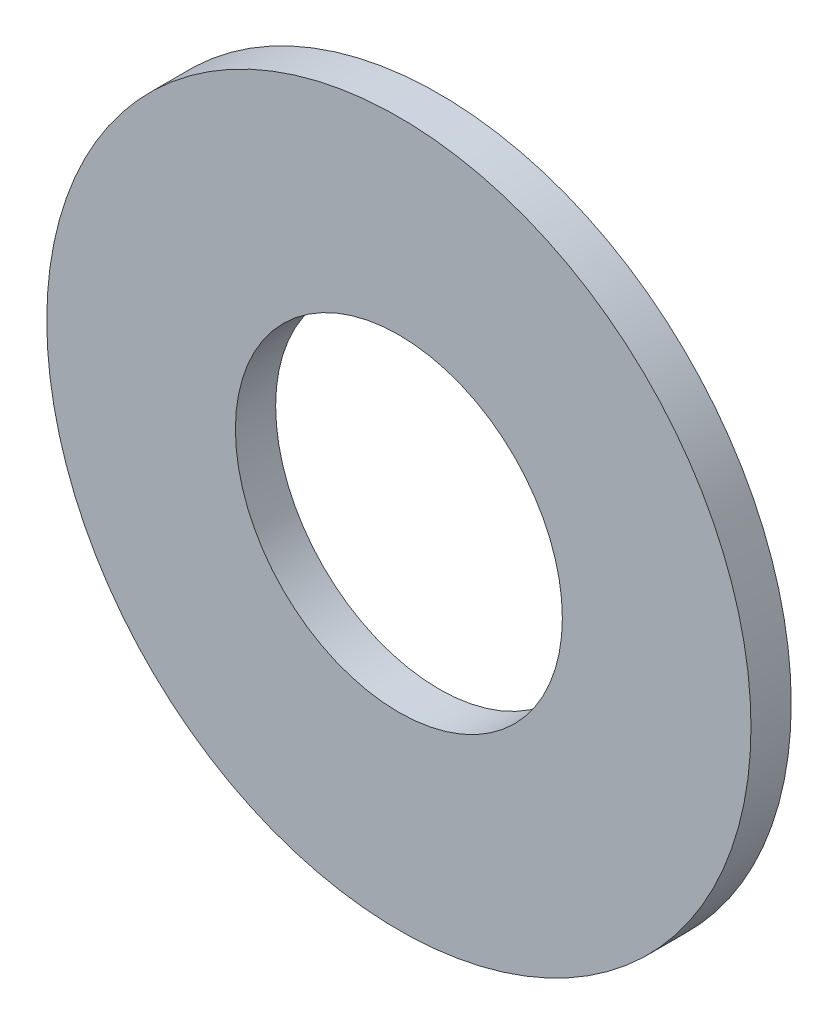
ISO-10303-21;
HEADER;
FILE_DESCRIPTION(('STEP AP214'),'2;1');
FILE_NAME('part.step','',(''),(''),'','','');
FILE_SCHEMA(('AUTOMOTIVE_DESIGN { 1 0 10303 214 1 1 1 1 }'));
ENDSEC;
DATA;
#1=APPLICATION_CONTEXT('core data for automotive mechanical design processes');
#2=APPLICATION_PROTOCOL_DEFINITION('international standard','automotive_design',2000,#1);
#3=PRODUCT_CONTEXT('',#1,'mechanical');
#4=PRODUCT('Part','Part','',(#3));
#5=PRODUCT_RELATED_PRODUCT_CATEGORY('part','',(#4));
#6=PRODUCT_DEFINITION_FORMATION('','',#4);
#7=PRODUCT_DEFINITION_CONTEXT('part definition',#1,'design');
#8=PRODUCT_DEFINITION('design','',#6,#7);
#9=PRODUCT_DEFINITION_SHAPE('','',#8);
#10=(LENGTH_UNIT() NAMED_UNIT(*) SI_UNIT(.MILLI.,.METRE.));
#11=(NAMED_UNIT(*) PLANE_ANGLE_UNIT() SI_UNIT($,.RADIAN.));
#12=(NAMED_UNIT(*) SI_UNIT($,.STERADIAN.) SOLID_ANGLE_UNIT());
#13=UNCERTAINTY_MEASURE_WITH_UNIT(LENGTH_MEASURE(1.E-05),#10,'distance_accuracy_value','');
#14=(GEOMETRIC_REPRESENTATION_CONTEXT(3) GLOBAL_UNCERTAINTY_ASSIGNED_CONTEXT((#13)) GLOBAL_UNIT_ASSIGNED_CONTEXT((#10,
#11,#12)) REPRESENTATION_CONTEXT('',''));
#15=CARTESIAN_POINT('',(0.,0.,0.));
#16=DIRECTION('',(0.,0.,1.));
#17=DIRECTION('',(1.,0.,0.));
#18=AXIS2_PLACEMENT_3D('',#15,#16,#17);
#19=CARTESIAN_POINT('',(0.,0.,1.27));
#20=DIRECTION('',(0.,0.,1.));
#21=DIRECTION('',(1.,0.,0.));
#22=AXIS2_PLACEMENT_3D('',#19,#20,#21);
#23=PLANE('',#22);
#24=CARTESIAN_POINT('',(0.,0.,1.27));
#25=DIRECTION('',(0.,0.,1.));
#26=DIRECTION('',(1.,0.,0.));
#27=AXIS2_PLACEMENT_3D('',#24,#25,#26);
#28=CIRCLE('',#27,11.1125);
#29=CARTESIAN_POINT('',(11.1125,0.,1.27));
#30=VERTEX_POINT('',#29);
#31=EDGE_CURVE('E10',#30,#30,#28,.T.);
#32=ORIENTED_EDGE('',*,*,#31,.T.);
#33=EDGE_LOOP('',(#32));
#34=FACE_BOUND('',#33,.T.);
#35=CARTESIAN_POINT('',(0.,0.,1.27));
#36=DIRECTION('',(0.,0.,1.));
#37=DIRECTION('',(1.,0.,0.));
#38=AXIS2_PLACEMENT_3D('',#35,#36,#37);
#39=CIRCLE('',#38,5.159375);
#40=CARTESIAN_POINT('',(5.159375,0.,1.27));
#41=VERTEX_POINT('',#40);
#42=EDGE_CURVE('E39',#41,#41,#39,.T.);
#43=ORIENTED_EDGE('',*,*,#42,.F.);
#44=EDGE_LOOP('',(#43));
#45=FACE_BOUND('',#44,.T.);
#46=ADVANCED_FACE('F28',(#34,#45),#23,.T.);
#47=CARTESIAN_POINT('',(0.,0.,0.));
#48=DIRECTION('',(0.,0.,1.));
#49=DIRECTION('',(1.,0.,0.));
#50=AXIS2_PLACEMENT_3D('',#47,#48,#49);
#51=PLANE('',#50);
#52=CARTESIAN_POINT('',(0.,0.,0.));
#53=DIRECTION('',(0.,0.,1.));
#54=DIRECTION('',(1.,0.,0.));
#55=AXIS2_PLACEMENT_3D('',#52,#53,#54);
#56=CIRCLE('',#55,11.1125);
#57=CARTESIAN_POINT('',(11.1125,0.,0.));
#58=VERTEX_POINT('',#57);
#59=EDGE_CURVE('E35',#58,#58,#56,.T.);
#60=ORIENTED_EDGE('',*,*,#59,.F.);
#61=EDGE_LOOP('',(#60));
#62=FACE_BOUND('',#61,.T.);
#63=CARTESIAN_POINT('',(0.,0.,0.));
#64=DIRECTION('',(0.,0.,1.));
#65=DIRECTION('',(1.,0.,0.));
#66=AXIS2_PLACEMENT_3D('',#63,#64,#65);
#67=CIRCLE('',#66,5.159375);
#68=CARTESIAN_POINT('',(5.159375,0.,0.));
#69=VERTEX_POINT('',#68);
#70=EDGE_CURVE('E43',#69,#69,#67,.T.);
#71=ORIENTED_EDGE('',*,*,#70,.T.);
#72=EDGE_LOOP('',(#71));
#73=FACE_BOUND('',#72,.T.);
#74=ADVANCED_FACE('F49',(#62,#73),#51,.F.);
#75=CARTESIAN_POINT('',(0.,0.,1.27));
#76=DIRECTION('',(0.,0.,-1.));
#77=DIRECTION('',(-1.,0.,0.));
#78=AXIS2_PLACEMENT_3D('',#75,#76,#77);
#79=CYLINDRICAL_SURFACE('',#78,11.1125);
#80=ORIENTED_EDGE('',*,*,#31,.F.);
#81=EDGE_LOOP('',(#80));
#82=FACE_BOUND('',#81,.T.);
#83=ORIENTED_EDGE('',*,*,#59,.T.);
#84=EDGE_LOOP('',(#83));
#85=FACE_BOUND('',#84,.T.);
#86=ADVANCED_FACE('F30',(#82,#85),#79,.T.);
#87=CARTESIAN_POINT('',(0.,0.,1.27));
#88=DIRECTION('',(0.,0.,-1.));
#89=DIRECTION('',(-1.,0.,0.));
#90=AXIS2_PLACEMENT_3D('',#87,#88,#89);
#91=CYLINDRICAL_SURFACE('',#90,5.159375);
#92=ORIENTED_EDGE('',*,*,#42,.T.);
#93=EDGE_LOOP('',(#92));
#94=FACE_BOUND('',#93,.T.);
#95=ORIENTED_EDGE('',*,*,#70,.F.);
#96=EDGE_LOOP('',(#95));
#97=FACE_BOUND('',#96,.T.);
#98=ADVANCED_FACE('F51',(#94,#97),#91,.F.);
#99=CLOSED_SHELL('',(#46,#74,#86,#98));
#100=MANIFOLD_SOLID_BREP('B2',#99);
#101=ADVANCED_BREP_SHAPE_REPRESENTATION('',(#18,#100),#14);
#102=SHAPE_DEFINITION_REPRESENTATION(#9,#101);
ENDSEC;
END-ISO-10303-21;
